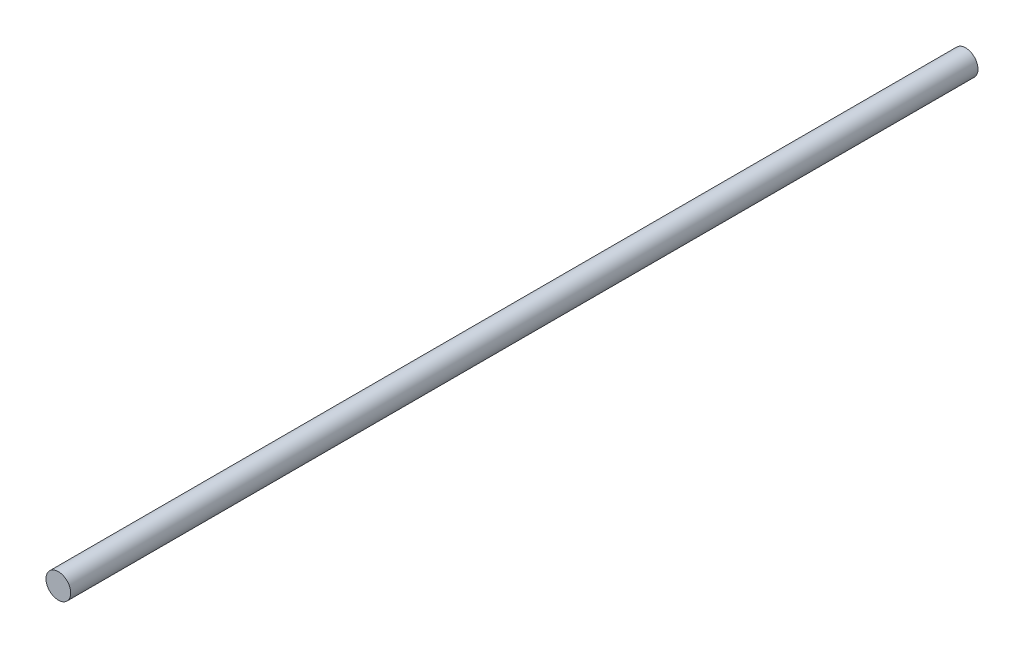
from build123d import *

# Parameters (mm, degrees)
SKETCH1_R           = 30
BOSS_EXTRUDE1_DEPTH = 2200


with BuildPart() as part:
    # Sketch1 → Boss-Extrude1 (new body)
    with BuildSketch(Plane.XY):
        Circle(SKETCH1_R)
    extrude(amount=-BOSS_EXTRUDE1_DEPTH)


solid = part.part
